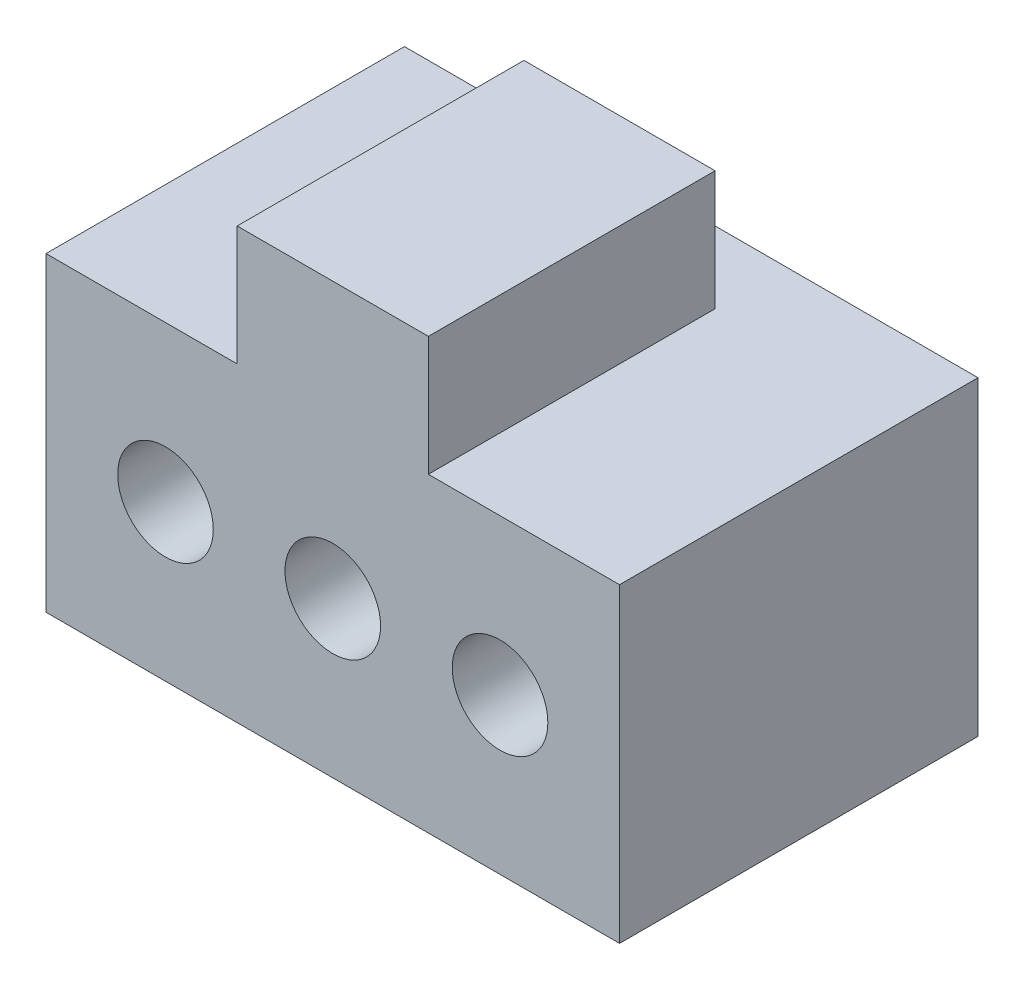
ISO-10303-21;
HEADER;
FILE_DESCRIPTION(('STEP AP214'),'2;1');
FILE_NAME('part.step','',(''),(''),'','','');
FILE_SCHEMA(('AUTOMOTIVE_DESIGN { 1 0 10303 214 1 1 1 1 }'));
ENDSEC;
DATA;
#1=APPLICATION_CONTEXT('core data for automotive mechanical design processes');
#2=APPLICATION_PROTOCOL_DEFINITION('international standard','automotive_design',2000,#1);
#3=PRODUCT_CONTEXT('',#1,'mechanical');
#4=PRODUCT('Part','Part','',(#3));
#5=PRODUCT_RELATED_PRODUCT_CATEGORY('part','',(#4));
#6=PRODUCT_DEFINITION_FORMATION('','',#4);
#7=PRODUCT_DEFINITION_CONTEXT('part definition',#1,'design');
#8=PRODUCT_DEFINITION('design','',#6,#7);
#9=PRODUCT_DEFINITION_SHAPE('','',#8);
#10=(LENGTH_UNIT() NAMED_UNIT(*) SI_UNIT(.MILLI.,.METRE.));
#11=(NAMED_UNIT(*) PLANE_ANGLE_UNIT() SI_UNIT($,.RADIAN.));
#12=(NAMED_UNIT(*) SI_UNIT($,.STERADIAN.) SOLID_ANGLE_UNIT());
#13=UNCERTAINTY_MEASURE_WITH_UNIT(LENGTH_MEASURE(1.E-05),#10,'distance_accuracy_value','');
#14=(GEOMETRIC_REPRESENTATION_CONTEXT(3) GLOBAL_UNCERTAINTY_ASSIGNED_CONTEXT((#13)) GLOBAL_UNIT_ASSIGNED_CONTEXT((#10,
#11,#12)) REPRESENTATION_CONTEXT('',''));
#15=CARTESIAN_POINT('',(0.,0.,0.));
#16=DIRECTION('',(0.,0.,1.));
#17=DIRECTION('',(1.,0.,0.));
#18=AXIS2_PLACEMENT_3D('',#15,#16,#17);
#19=CARTESIAN_POINT('',(-60.,32.5,-75.));
#20=DIRECTION('',(-1.,0.,0.));
#21=DIRECTION('',(0.,0.,1.));
#22=AXIS2_PLACEMENT_3D('',#19,#20,#21);
#23=PLANE('',#22);
#24=DIRECTION('',(0.,-1.,0.));
#25=VECTOR('',#24,1.);
#26=CARTESIAN_POINT('',(-60.,32.5,0.));
#27=LINE('',#26,#25);
#28=CARTESIAN_POINT('',(-60.,32.5,0.));
#29=VERTEX_POINT('',#28);
#30=CARTESIAN_POINT('',(-60.,-32.5,0.));
#31=VERTEX_POINT('',#30);
#32=EDGE_CURVE('E156',#29,#31,#27,.T.);
#33=ORIENTED_EDGE('',*,*,#32,.F.);
#34=DIRECTION('',(0.,0.,1.));
#35=VECTOR('',#34,1.);
#36=CARTESIAN_POINT('',(-60.,32.5,-75.));
#37=LINE('',#36,#35);
#38=CARTESIAN_POINT('',(-60.,32.5,-75.));
#39=VERTEX_POINT('',#38);
#40=EDGE_CURVE('E11',#39,#29,#37,.T.);
#41=ORIENTED_EDGE('',*,*,#40,.F.);
#42=DIRECTION('',(0.,-1.,0.));
#43=VECTOR('',#42,1.);
#44=CARTESIAN_POINT('',(-60.,32.5,-75.));
#45=LINE('',#44,#43);
#46=CARTESIAN_POINT('',(-60.,-32.5,-75.));
#47=VERTEX_POINT('',#46);
#48=EDGE_CURVE('E159',#39,#47,#45,.T.);
#49=ORIENTED_EDGE('',*,*,#48,.T.);
#50=DIRECTION('',(0.,0.,1.));
#51=VECTOR('',#50,1.);
#52=CARTESIAN_POINT('',(-60.,-32.5,-75.));
#53=LINE('',#52,#51);
#54=EDGE_CURVE('E83',#47,#31,#53,.T.);
#55=ORIENTED_EDGE('',*,*,#54,.T.);
#56=EDGE_LOOP('',(#33,#41,#49,#55));
#57=FACE_BOUND('',#56,.T.);
#58=ADVANCED_FACE('F31',(#57),#23,.T.);
#59=CARTESIAN_POINT('',(-60.,32.5,-75.));
#60=DIRECTION('',(0.,1.,0.));
#61=DIRECTION('',(0.,0.,1.));
#62=AXIS2_PLACEMENT_3D('',#59,#60,#61);
#63=PLANE('',#62);
#64=DIRECTION('',(0.,0.,1.));
#65=VECTOR('',#64,1.);
#66=CARTESIAN_POINT('',(-20.,32.5,-60.));
#67=LINE('',#66,#65);
#68=CARTESIAN_POINT('',(-20.,32.5,-60.));
#69=VERTEX_POINT('',#68);
#70=CARTESIAN_POINT('',(-20.,32.5,0.));
#71=VERTEX_POINT('',#70);
#72=EDGE_CURVE('E122',#69,#71,#67,.T.);
#73=ORIENTED_EDGE('',*,*,#72,.F.);
#74=DIRECTION('',(1.,0.,0.));
#75=VECTOR('',#74,1.);
#76=CARTESIAN_POINT('',(-20.,32.5,-60.));
#77=LINE('',#76,#75);
#78=CARTESIAN_POINT('',(20.,32.5,-60.));
#79=VERTEX_POINT('',#78);
#80=EDGE_CURVE('E108',#69,#79,#77,.T.);
#81=ORIENTED_EDGE('',*,*,#80,.T.);
#82=DIRECTION('',(0.,0.,1.));
#83=VECTOR('',#82,1.);
#84=CARTESIAN_POINT('',(20.,32.5,-60.));
#85=LINE('',#84,#83);
#86=CARTESIAN_POINT('',(20.,32.5,0.));
#87=VERTEX_POINT('',#86);
#88=EDGE_CURVE('E127',#79,#87,#85,.T.);
#89=ORIENTED_EDGE('',*,*,#88,.T.);
#90=DIRECTION('',(-1.,0.,0.));
#91=VECTOR('',#90,1.);
#92=CARTESIAN_POINT('',(-60.,32.5,0.));
#93=LINE('',#92,#91);
#94=CARTESIAN_POINT('',(60.,32.5,0.));
#95=VERTEX_POINT('',#94);
#96=EDGE_CURVE('E162',#95,#87,#93,.T.);
#97=ORIENTED_EDGE('',*,*,#96,.F.);
#98=DIRECTION('',(0.,0.,1.));
#99=VECTOR('',#98,1.);
#100=CARTESIAN_POINT('',(60.,32.5,-75.));
#101=LINE('',#100,#99);
#102=CARTESIAN_POINT('',(60.,32.5,-75.));
#103=VERTEX_POINT('',#102);
#104=EDGE_CURVE('E39',#103,#95,#101,.T.);
#105=ORIENTED_EDGE('',*,*,#104,.F.);
#106=DIRECTION('',(-1.,0.,0.));
#107=VECTOR('',#106,1.);
#108=CARTESIAN_POINT('',(-60.,32.5,-75.));
#109=LINE('',#108,#107);
#110=EDGE_CURVE('E167',#103,#39,#109,.T.);
#111=ORIENTED_EDGE('',*,*,#110,.T.);
#112=ORIENTED_EDGE('',*,*,#40,.T.);
#113=EDGE_CURVE('E77',#71,#29,#93,.T.);
#114=ORIENTED_EDGE('',*,*,#113,.F.);
#115=EDGE_LOOP('',(#73,#81,#89,#97,#105,#111,#112,#114));
#116=FACE_BOUND('',#115,.T.);
#117=ADVANCED_FACE('F126',(#116),#63,.T.);
#118=CARTESIAN_POINT('',(60.,32.5,-75.));
#119=DIRECTION('',(1.,0.,0.));
#120=DIRECTION('',(0.,0.,-1.));
#121=AXIS2_PLACEMENT_3D('',#118,#119,#120);
#122=PLANE('',#121);
#123=DIRECTION('',(0.,1.,0.));
#124=VECTOR('',#123,1.);
#125=CARTESIAN_POINT('',(60.,32.5,0.));
#126=LINE('',#125,#124);
#127=CARTESIAN_POINT('',(60.,-32.5,0.));
#128=VERTEX_POINT('',#127);
#129=EDGE_CURVE('E174',#128,#95,#126,.T.);
#130=ORIENTED_EDGE('',*,*,#129,.F.);
#131=DIRECTION('',(0.,0.,1.));
#132=VECTOR('',#131,1.);
#133=CARTESIAN_POINT('',(60.,-32.5,-75.));
#134=LINE('',#133,#132);
#135=CARTESIAN_POINT('',(60.,-32.5,-75.));
#136=VERTEX_POINT('',#135);
#137=EDGE_CURVE('E185',#136,#128,#134,.T.);
#138=ORIENTED_EDGE('',*,*,#137,.F.);
#139=DIRECTION('',(0.,1.,0.));
#140=VECTOR('',#139,1.);
#141=CARTESIAN_POINT('',(60.,32.5,-75.));
#142=LINE('',#141,#140);
#143=EDGE_CURVE('E164',#136,#103,#142,.T.);
#144=ORIENTED_EDGE('',*,*,#143,.T.);
#145=ORIENTED_EDGE('',*,*,#104,.T.);
#146=EDGE_LOOP('',(#130,#138,#144,#145));
#147=FACE_BOUND('',#146,.T.);
#148=ADVANCED_FACE('F188',(#147),#122,.T.);
#149=CARTESIAN_POINT('',(-60.,-32.5,-75.));
#150=DIRECTION('',(0.,-1.,0.));
#151=DIRECTION('',(0.,0.,-1.));
#152=AXIS2_PLACEMENT_3D('',#149,#150,#151);
#153=PLANE('',#152);
#154=DIRECTION('',(1.,0.,0.));
#155=VECTOR('',#154,1.);
#156=CARTESIAN_POINT('',(-60.,-32.5,0.));
#157=LINE('',#156,#155);
#158=EDGE_CURVE('E171',#31,#128,#157,.T.);
#159=ORIENTED_EDGE('',*,*,#158,.F.);
#160=ORIENTED_EDGE('',*,*,#54,.F.);
#161=DIRECTION('',(1.,0.,0.));
#162=VECTOR('',#161,1.);
#163=CARTESIAN_POINT('',(-60.,-32.5,-75.));
#164=LINE('',#163,#162);
#165=EDGE_CURVE('E161',#47,#136,#164,.T.);
#166=ORIENTED_EDGE('',*,*,#165,.T.);
#167=ORIENTED_EDGE('',*,*,#137,.T.);
#168=EDGE_LOOP('',(#159,#160,#166,#167));
#169=FACE_BOUND('',#168,.T.);
#170=ADVANCED_FACE('F211',(#169),#153,.T.);
#171=CARTESIAN_POINT('',(-60.,-32.5,-75.));
#172=DIRECTION('',(0.,0.,1.));
#173=DIRECTION('',(1.,0.,0.));
#174=AXIS2_PLACEMENT_3D('',#171,#172,#173);
#175=PLANE('',#174);
#176=CARTESIAN_POINT('',(-35.,0.,-75.));
#177=DIRECTION('',(0.,0.,1.));
#178=DIRECTION('',(1.,0.,0.));
#179=AXIS2_PLACEMENT_3D('',#176,#177,#178);
#180=CIRCLE('',#179,10.);
#181=CARTESIAN_POINT('',(-25.,0.,-75.));
#182=VERTEX_POINT('',#181);
#183=EDGE_CURVE('E310',#182,#182,#180,.T.);
#184=ORIENTED_EDGE('',*,*,#183,.T.);
#185=EDGE_LOOP('',(#184));
#186=FACE_BOUND('',#185,.T.);
#187=CARTESIAN_POINT('',(35.,0.,-75.));
#188=DIRECTION('',(0.,0.,1.));
#189=DIRECTION('',(1.,0.,0.));
#190=AXIS2_PLACEMENT_3D('',#187,#188,#189);
#191=CIRCLE('',#190,10.);
#192=CARTESIAN_POINT('',(45.,0.,-75.));
#193=VERTEX_POINT('',#192);
#194=EDGE_CURVE('E147',#193,#193,#191,.T.);
#195=ORIENTED_EDGE('',*,*,#194,.T.);
#196=EDGE_LOOP('',(#195));
#197=FACE_BOUND('',#196,.T.);
#198=CARTESIAN_POINT('',(0.,0.,-75.));
#199=DIRECTION('',(0.,0.,1.));
#200=DIRECTION('',(1.,0.,0.));
#201=AXIS2_PLACEMENT_3D('',#198,#199,#200);
#202=CIRCLE('',#201,10.);
#203=CARTESIAN_POINT('',(10.,0.,-75.));
#204=VERTEX_POINT('',#203);
#205=EDGE_CURVE('E138',#204,#204,#202,.T.);
#206=ORIENTED_EDGE('',*,*,#205,.T.);
#207=EDGE_LOOP('',(#206));
#208=FACE_BOUND('',#207,.T.);
#209=ORIENTED_EDGE('',*,*,#48,.F.);
#210=ORIENTED_EDGE('',*,*,#110,.F.);
#211=ORIENTED_EDGE('',*,*,#143,.F.);
#212=ORIENTED_EDGE('',*,*,#165,.F.);
#213=EDGE_LOOP('',(#209,#210,#211,#212));
#214=FACE_BOUND('',#213,.T.);
#215=ADVANCED_FACE('F213',(#186,#197,#208,#214),#175,.F.);
#216=CARTESIAN_POINT('',(-60.,-32.5,0.));
#217=DIRECTION('',(0.,0.,1.));
#218=DIRECTION('',(1.,0.,0.));
#219=AXIS2_PLACEMENT_3D('',#216,#217,#218);
#220=PLANE('',#219);
#221=CARTESIAN_POINT('',(-35.,0.,0.));
#222=DIRECTION('',(0.,0.,1.));
#223=DIRECTION('',(1.,0.,0.));
#224=AXIS2_PLACEMENT_3D('',#221,#222,#223);
#225=CIRCLE('',#224,10.);
#226=CARTESIAN_POINT('',(-25.,0.,0.));
#227=VERTEX_POINT('',#226);
#228=EDGE_CURVE('E313',#227,#227,#225,.T.);
#229=ORIENTED_EDGE('',*,*,#228,.F.);
#230=EDGE_LOOP('',(#229));
#231=FACE_BOUND('',#230,.T.);
#232=CARTESIAN_POINT('',(35.,0.,0.));
#233=DIRECTION('',(0.,0.,1.));
#234=DIRECTION('',(1.,0.,0.));
#235=AXIS2_PLACEMENT_3D('',#232,#233,#234);
#236=CIRCLE('',#235,10.);
#237=CARTESIAN_POINT('',(45.,0.,0.));
#238=VERTEX_POINT('',#237);
#239=EDGE_CURVE('E150',#238,#238,#236,.T.);
#240=ORIENTED_EDGE('',*,*,#239,.F.);
#241=EDGE_LOOP('',(#240));
#242=FACE_BOUND('',#241,.T.);
#243=CARTESIAN_POINT('',(0.,0.,0.));
#244=DIRECTION('',(0.,0.,1.));
#245=DIRECTION('',(1.,0.,0.));
#246=AXIS2_PLACEMENT_3D('',#243,#244,#245);
#247=CIRCLE('',#246,10.);
#248=CARTESIAN_POINT('',(10.,0.,0.));
#249=VERTEX_POINT('',#248);
#250=EDGE_CURVE('E142',#249,#249,#247,.T.);
#251=ORIENTED_EDGE('',*,*,#250,.F.);
#252=EDGE_LOOP('',(#251));
#253=FACE_BOUND('',#252,.T.);
#254=ORIENTED_EDGE('',*,*,#32,.T.);
#255=ORIENTED_EDGE('',*,*,#158,.T.);
#256=ORIENTED_EDGE('',*,*,#129,.T.);
#257=ORIENTED_EDGE('',*,*,#96,.T.);
#258=DIRECTION('',(0.,1.,0.));
#259=VECTOR('',#258,1.);
#260=CARTESIAN_POINT('',(20.,57.5,0.));
#261=LINE('',#260,#259);
#262=CARTESIAN_POINT('',(20.,57.5,0.));
#263=VERTEX_POINT('',#262);
#264=EDGE_CURVE('E47',#87,#263,#261,.T.);
#265=ORIENTED_EDGE('',*,*,#264,.T.);
#266=DIRECTION('',(-1.,0.,0.));
#267=VECTOR('',#266,1.);
#268=CARTESIAN_POINT('',(-20.,57.5,0.));
#269=LINE('',#268,#267);
#270=CARTESIAN_POINT('',(-20.,57.5,0.));
#271=VERTEX_POINT('',#270);
#272=EDGE_CURVE('E124',#263,#271,#269,.T.);
#273=ORIENTED_EDGE('',*,*,#272,.T.);
#274=DIRECTION('',(0.,-1.,0.));
#275=VECTOR('',#274,1.);
#276=CARTESIAN_POINT('',(-20.,57.5,0.));
#277=LINE('',#276,#275);
#278=EDGE_CURVE('E137',#271,#71,#277,.T.);
#279=ORIENTED_EDGE('',*,*,#278,.T.);
#280=ORIENTED_EDGE('',*,*,#113,.T.);
#281=EDGE_LOOP('',(#254,#255,#256,#257,#265,#273,#279,#280));
#282=FACE_BOUND('',#281,.T.);
#283=ADVANCED_FACE('F192',(#231,#242,#253,#282),#220,.T.);
#284=CARTESIAN_POINT('',(-20.,57.5,-60.));
#285=DIRECTION('',(-1.,0.,0.));
#286=DIRECTION('',(0.,-1.,0.));
#287=AXIS2_PLACEMENT_3D('',#284,#285,#286);
#288=PLANE('',#287);
#289=ORIENTED_EDGE('',*,*,#278,.F.);
#290=DIRECTION('',(0.,0.,1.));
#291=VECTOR('',#290,1.);
#292=CARTESIAN_POINT('',(-20.,57.5,-60.));
#293=LINE('',#292,#291);
#294=CARTESIAN_POINT('',(-20.,57.5,-60.));
#295=VERTEX_POINT('',#294);
#296=EDGE_CURVE('E123',#295,#271,#293,.T.);
#297=ORIENTED_EDGE('',*,*,#296,.F.);
#298=DIRECTION('',(0.,-1.,0.));
#299=VECTOR('',#298,1.);
#300=CARTESIAN_POINT('',(-20.,57.5,-60.));
#301=LINE('',#300,#299);
#302=EDGE_CURVE('E112',#295,#69,#301,.T.);
#303=ORIENTED_EDGE('',*,*,#302,.T.);
#304=ORIENTED_EDGE('',*,*,#72,.T.);
#305=EDGE_LOOP('',(#289,#297,#303,#304));
#306=FACE_BOUND('',#305,.T.);
#307=ADVANCED_FACE('F121',(#306),#288,.T.);
#308=CARTESIAN_POINT('',(-20.,57.5,-60.));
#309=DIRECTION('',(0.,1.,0.));
#310=DIRECTION('',(0.,0.,1.));
#311=AXIS2_PLACEMENT_3D('',#308,#309,#310);
#312=PLANE('',#311);
#313=ORIENTED_EDGE('',*,*,#272,.F.);
#314=DIRECTION('',(0.,0.,1.));
#315=VECTOR('',#314,1.);
#316=CARTESIAN_POINT('',(20.,57.5,-60.));
#317=LINE('',#316,#315);
#318=CARTESIAN_POINT('',(20.,57.5,-60.));
#319=VERTEX_POINT('',#318);
#320=EDGE_CURVE('E130',#319,#263,#317,.T.);
#321=ORIENTED_EDGE('',*,*,#320,.F.);
#322=DIRECTION('',(-1.,0.,0.));
#323=VECTOR('',#322,1.);
#324=CARTESIAN_POINT('',(-20.,57.5,-60.));
#325=LINE('',#324,#323);
#326=EDGE_CURVE('E128',#319,#295,#325,.T.);
#327=ORIENTED_EDGE('',*,*,#326,.T.);
#328=ORIENTED_EDGE('',*,*,#296,.T.);
#329=EDGE_LOOP('',(#313,#321,#327,#328));
#330=FACE_BOUND('',#329,.T.);
#331=ADVANCED_FACE('F196',(#330),#312,.T.);
#332=CARTESIAN_POINT('',(20.,57.5,-60.));
#333=DIRECTION('',(1.,0.,0.));
#334=DIRECTION('',(0.,1.,0.));
#335=AXIS2_PLACEMENT_3D('',#332,#333,#334);
#336=PLANE('',#335);
#337=ORIENTED_EDGE('',*,*,#264,.F.);
#338=ORIENTED_EDGE('',*,*,#88,.F.);
#339=DIRECTION('',(0.,1.,0.));
#340=VECTOR('',#339,1.);
#341=CARTESIAN_POINT('',(20.,57.5,-60.));
#342=LINE('',#341,#340);
#343=EDGE_CURVE('E115',#79,#319,#342,.T.);
#344=ORIENTED_EDGE('',*,*,#343,.T.);
#345=ORIENTED_EDGE('',*,*,#320,.T.);
#346=EDGE_LOOP('',(#337,#338,#344,#345));
#347=FACE_BOUND('',#346,.T.);
#348=ADVANCED_FACE('F193',(#347),#336,.T.);
#349=CARTESIAN_POINT('',(-20.,32.5,-60.));
#350=DIRECTION('',(0.,0.,1.));
#351=DIRECTION('',(1.,0.,0.));
#352=AXIS2_PLACEMENT_3D('',#349,#350,#351);
#353=PLANE('',#352);
#354=ORIENTED_EDGE('',*,*,#302,.F.);
#355=ORIENTED_EDGE('',*,*,#326,.F.);
#356=ORIENTED_EDGE('',*,*,#343,.F.);
#357=ORIENTED_EDGE('',*,*,#80,.F.);
#358=EDGE_LOOP('',(#354,#355,#356,#357));
#359=FACE_BOUND('',#358,.T.);
#360=ADVANCED_FACE('F110',(#359),#353,.F.);
#361=CARTESIAN_POINT('',(0.,0.,-75.));
#362=DIRECTION('',(0.,0.,1.));
#363=DIRECTION('',(1.,0.,0.));
#364=AXIS2_PLACEMENT_3D('',#361,#362,#363);
#365=CYLINDRICAL_SURFACE('',#364,10.);
#366=ORIENTED_EDGE('',*,*,#205,.F.);
#367=EDGE_LOOP('',(#366));
#368=FACE_BOUND('',#367,.T.);
#369=ORIENTED_EDGE('',*,*,#250,.T.);
#370=EDGE_LOOP('',(#369));
#371=FACE_BOUND('',#370,.T.);
#372=ADVANCED_FACE('F266',(#368,#371),#365,.F.);
#373=CARTESIAN_POINT('',(35.,0.,-75.));
#374=DIRECTION('',(0.,0.,1.));
#375=DIRECTION('',(1.,0.,0.));
#376=AXIS2_PLACEMENT_3D('',#373,#374,#375);
#377=CYLINDRICAL_SURFACE('',#376,10.);
#378=ORIENTED_EDGE('',*,*,#194,.F.);
#379=EDGE_LOOP('',(#378));
#380=FACE_BOUND('',#379,.T.);
#381=ORIENTED_EDGE('',*,*,#239,.T.);
#382=EDGE_LOOP('',(#381));
#383=FACE_BOUND('',#382,.T.);
#384=ADVANCED_FACE('F284',(#380,#383),#377,.F.);
#385=CARTESIAN_POINT('',(-35.,0.,-75.));
#386=DIRECTION('',(0.,0.,1.));
#387=DIRECTION('',(1.,0.,0.));
#388=AXIS2_PLACEMENT_3D('',#385,#386,#387);
#389=CYLINDRICAL_SURFACE('',#388,10.);
#390=ORIENTED_EDGE('',*,*,#183,.F.);
#391=EDGE_LOOP('',(#390));
#392=FACE_BOUND('',#391,.T.);
#393=ORIENTED_EDGE('',*,*,#228,.T.);
#394=EDGE_LOOP('',(#393));
#395=FACE_BOUND('',#394,.T.);
#396=ADVANCED_FACE('F294',(#392,#395),#389,.F.);
#397=CLOSED_SHELL('',(#58,#117,#148,#170,#215,#283,#307,#331,#348,#360,#372,#384,#396));
#398=MANIFOLD_SOLID_BREP('B2',#397);
#399=ADVANCED_BREP_SHAPE_REPRESENTATION('',(#18,#398),#14);
#400=SHAPE_DEFINITION_REPRESENTATION(#9,#399);
ENDSEC;
END-ISO-10303-21;
